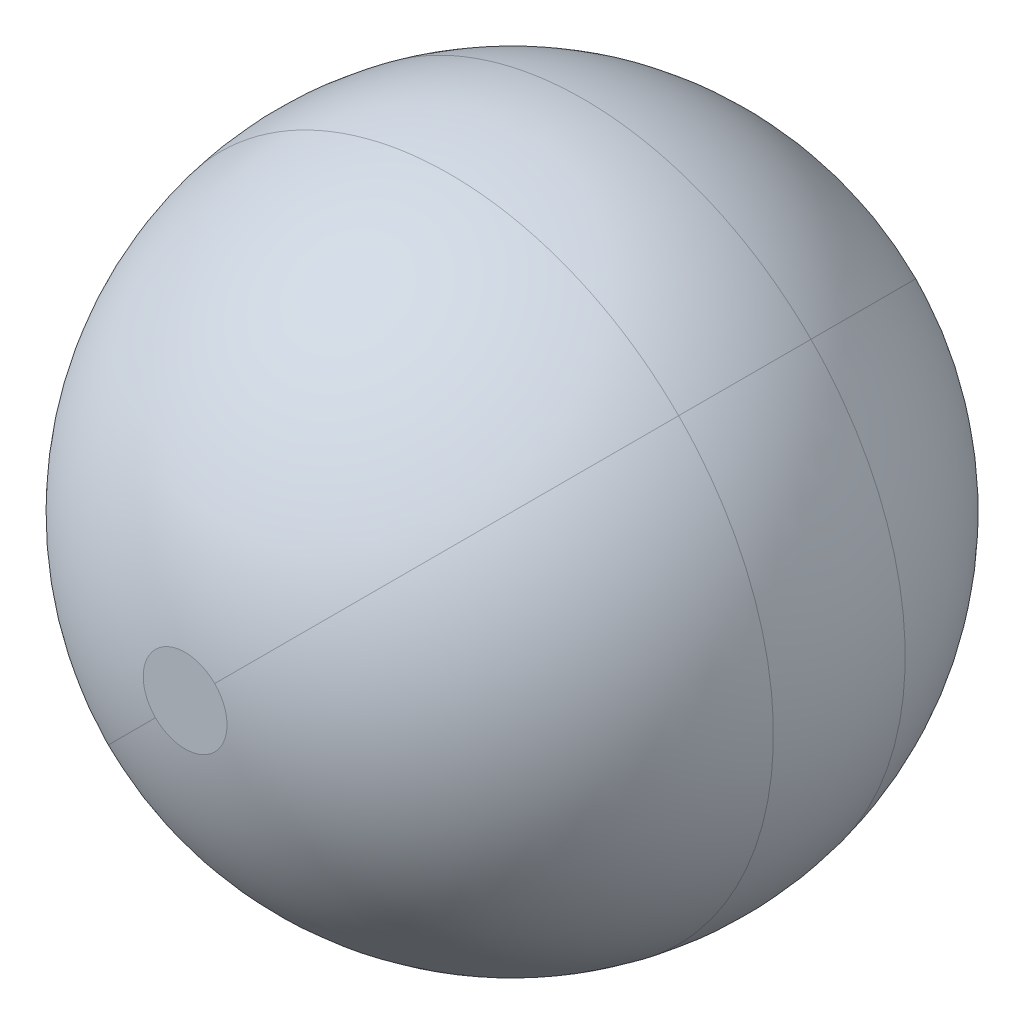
ISO-10303-21;
HEADER;
FILE_DESCRIPTION(('STEP AP214'),'2;1');
FILE_NAME('part.step','',(''),(''),'','','');
FILE_SCHEMA(('AUTOMOTIVE_DESIGN { 1 0 10303 214 1 1 1 1 }'));
ENDSEC;
DATA;
#1=APPLICATION_CONTEXT('core data for automotive mechanical design processes');
#2=APPLICATION_PROTOCOL_DEFINITION('international standard','automotive_design',2000,#1);
#3=PRODUCT_CONTEXT('',#1,'mechanical');
#4=PRODUCT('Part','Part','',(#3));
#5=PRODUCT_RELATED_PRODUCT_CATEGORY('part','',(#4));
#6=PRODUCT_DEFINITION_FORMATION('','',#4);
#7=PRODUCT_DEFINITION_CONTEXT('part definition',#1,'design');
#8=PRODUCT_DEFINITION('design','',#6,#7);
#9=PRODUCT_DEFINITION_SHAPE('','',#8);
#10=(LENGTH_UNIT() NAMED_UNIT(*) SI_UNIT(.MILLI.,.METRE.));
#11=(NAMED_UNIT(*) PLANE_ANGLE_UNIT() SI_UNIT($,.RADIAN.));
#12=(NAMED_UNIT(*) SI_UNIT($,.STERADIAN.) SOLID_ANGLE_UNIT());
#13=UNCERTAINTY_MEASURE_WITH_UNIT(LENGTH_MEASURE(1.E-05),#10,'distance_accuracy_value','');
#14=(GEOMETRIC_REPRESENTATION_CONTEXT(3) GLOBAL_UNCERTAINTY_ASSIGNED_CONTEXT((#13)) GLOBAL_UNIT_ASSIGNED_CONTEXT((#10,
#11,#12)) REPRESENTATION_CONTEXT('',''));
#15=CARTESIAN_POINT('',(0.,0.,0.));
#16=DIRECTION('',(0.,0.,1.));
#17=DIRECTION('',(1.,0.,0.));
#18=AXIS2_PLACEMENT_3D('',#15,#16,#17);
#19=CARTESIAN_POINT('',(0.,0.,0.));
#20=DIRECTION('',(0.,-1.,0.));
#21=DIRECTION('',(-1.,0.,0.));
#22=AXIS2_PLACEMENT_3D('',#19,#20,#21);
#23=SPHERICAL_SURFACE('',#22,2.466);
#24=CARTESIAN_POINT('',(0.,0.,0.));
#25=DIRECTION('',(-0.707106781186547,0.707106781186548,0.));
#26=DIRECTION('',(-0.707106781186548,-0.707106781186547,0.));
#27=AXIS2_PLACEMENT_3D('',#24,#25,#26);
#28=CIRCLE('',#27,2.466);
#29=CARTESIAN_POINT('',(1.70235131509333,1.70235131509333,-0.534));
#30=VERTEX_POINT('',#29);
#31=CARTESIAN_POINT('',(1.71230838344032,1.71230838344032,0.466));
#32=VERTEX_POINT('',#31);
#33=EDGE_CURVE('E99',#30,#32,#28,.F.);
#34=ORIENTED_EDGE('',*,*,#33,.F.);
#35=CARTESIAN_POINT('',(0.,0.,-0.534));
#36=DIRECTION('',(0.,0.,1.));
#37=DIRECTION('',(1.,0.,0.));
#38=AXIS2_PLACEMENT_3D('',#35,#36,#37);
#39=CIRCLE('',#38,2.40748831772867);
#40=CARTESIAN_POINT('',(-1.70235131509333,-1.70235131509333,-0.534));
#41=VERTEX_POINT('',#40);
#42=EDGE_CURVE('E12',#30,#41,#39,.T.);
#43=ORIENTED_EDGE('',*,*,#42,.T.);
#44=CARTESIAN_POINT('',(-1.71230838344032,-1.71230838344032,0.466));
#45=VERTEX_POINT('',#44);
#46=EDGE_CURVE('E96',#45,#41,#28,.F.);
#47=ORIENTED_EDGE('',*,*,#46,.F.);
#48=CARTESIAN_POINT('',(0.,0.,0.466));
#49=DIRECTION('',(0.,0.,1.));
#50=DIRECTION('',(1.,0.,0.));
#51=AXIS2_PLACEMENT_3D('',#48,#49,#50);
#52=CIRCLE('',#51,2.42156973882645);
#53=EDGE_CURVE('E56',#32,#45,#52,.T.);
#54=ORIENTED_EDGE('',*,*,#53,.F.);
#55=EDGE_LOOP('',(#34,#43,#47,#54));
#56=FACE_BOUND('',#55,.T.);
#57=ADVANCED_FACE('F48',(#56),#23,.T.);
#58=CARTESIAN_POINT('',(0.221630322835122,0.221630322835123,2.446));
#59=VERTEX_POINT('',#58);
#60=EDGE_CURVE('E109',#32,#59,#28,.F.);
#61=ORIENTED_EDGE('',*,*,#60,.F.);
#62=ORIENTED_EDGE('',*,*,#53,.T.);
#63=CARTESIAN_POINT('',(-0.221630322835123,-0.221630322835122,2.446));
#64=VERTEX_POINT('',#63);
#65=EDGE_CURVE('E111',#64,#45,#28,.F.);
#66=ORIENTED_EDGE('',*,*,#65,.F.);
#67=CARTESIAN_POINT('',(0.,0.,2.446));
#68=DIRECTION('',(0.,0.,-1.));
#69=DIRECTION('',(-1.,0.,0.));
#70=AXIS2_PLACEMENT_3D('',#67,#68,#69);
#71=CIRCLE('',#70,0.313432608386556);
#72=EDGE_CURVE('E106',#64,#59,#71,.T.);
#73=ORIENTED_EDGE('',*,*,#72,.T.);
#74=EDGE_LOOP('',(#61,#62,#66,#73));
#75=FACE_BOUND('',#74,.T.);
#76=ADVANCED_FACE('F123',(#75),#23,.T.);
#77=ORIENTED_EDGE('',*,*,#46,.T.);
#78=CARTESIAN_POINT('',(0.,0.,-0.534));
#79=DIRECTION('',(0.,0.,1.));
#80=DIRECTION('',(1.,0.,0.));
#81=AXIS2_PLACEMENT_3D('',#78,#79,#80);
#82=CIRCLE('',#81,2.40748831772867);
#83=EDGE_CURVE('E92',#41,#30,#82,.T.);
#84=ORIENTED_EDGE('',*,*,#83,.T.);
#85=ORIENTED_EDGE('',*,*,#33,.T.);
#86=CARTESIAN_POINT('',(0.,0.,0.466));
#87=DIRECTION('',(0.,0.,1.));
#88=DIRECTION('',(1.,0.,0.));
#89=AXIS2_PLACEMENT_3D('',#86,#87,#88);
#90=CIRCLE('',#89,2.42156973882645);
#91=EDGE_CURVE('E103',#45,#32,#90,.T.);
#92=ORIENTED_EDGE('',*,*,#91,.F.);
#93=EDGE_LOOP('',(#77,#84,#85,#92));
#94=FACE_BOUND('',#93,.T.);
#95=ADVANCED_FACE('F126',(#94),#23,.T.);
#96=ORIENTED_EDGE('',*,*,#65,.T.);
#97=ORIENTED_EDGE('',*,*,#91,.T.);
#98=ORIENTED_EDGE('',*,*,#60,.T.);
#99=CARTESIAN_POINT('',(0.,0.,2.446));
#100=DIRECTION('',(0.,0.,-1.));
#101=DIRECTION('',(-1.,0.,0.));
#102=AXIS2_PLACEMENT_3D('',#99,#100,#101);
#103=CIRCLE('',#102,0.313432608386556);
#104=EDGE_CURVE('E104',#59,#64,#103,.T.);
#105=ORIENTED_EDGE('',*,*,#104,.T.);
#106=EDGE_LOOP('',(#96,#97,#98,#105));
#107=FACE_BOUND('',#106,.T.);
#108=ADVANCED_FACE('F129',(#107),#23,.T.);
#109=ORIENTED_EDGE('',*,*,#42,.F.);
#110=CARTESIAN_POINT('',(0.156875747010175,0.156875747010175,-2.456));
#111=VERTEX_POINT('',#110);
#112=EDGE_CURVE('E97',#111,#30,#28,.F.);
#113=ORIENTED_EDGE('',*,*,#112,.F.);
#114=CARTESIAN_POINT('',(0.,0.,-2.456));
#115=DIRECTION('',(0.,0.,-1.));
#116=DIRECTION('',(-1.,0.,0.));
#117=AXIS2_PLACEMENT_3D('',#114,#115,#116);
#118=CIRCLE('',#117,0.221855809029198);
#119=CARTESIAN_POINT('',(-0.156875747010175,-0.156875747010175,-2.456));
#120=VERTEX_POINT('',#119);
#121=EDGE_CURVE('E102',#120,#111,#118,.T.);
#122=ORIENTED_EDGE('',*,*,#121,.F.);
#123=EDGE_CURVE('E87',#41,#120,#28,.F.);
#124=ORIENTED_EDGE('',*,*,#123,.F.);
#125=EDGE_LOOP('',(#109,#113,#122,#124));
#126=FACE_BOUND('',#125,.T.);
#127=ADVANCED_FACE('F50',(#126),#23,.T.);
#128=ORIENTED_EDGE('',*,*,#83,.F.);
#129=ORIENTED_EDGE('',*,*,#123,.T.);
#130=CARTESIAN_POINT('',(0.,0.,-2.456));
#131=DIRECTION('',(0.,0.,-1.));
#132=DIRECTION('',(-1.,0.,0.));
#133=AXIS2_PLACEMENT_3D('',#130,#131,#132);
#134=CIRCLE('',#133,0.221855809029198);
#135=EDGE_CURVE('E91',#111,#120,#134,.T.);
#136=ORIENTED_EDGE('',*,*,#135,.F.);
#137=ORIENTED_EDGE('',*,*,#112,.T.);
#138=EDGE_LOOP('',(#128,#129,#136,#137));
#139=FACE_BOUND('',#138,.T.);
#140=ADVANCED_FACE('F89',(#139),#23,.T.);
#141=CARTESIAN_POINT('',(0.,0.,2.446));
#142=DIRECTION('',(0.,0.,-1.));
#143=DIRECTION('',(1.,0.,0.));
#144=AXIS2_PLACEMENT_3D('',#141,#142,#143);
#145=PLANE('',#144);
#146=ORIENTED_EDGE('',*,*,#104,.F.);
#147=ORIENTED_EDGE('',*,*,#72,.F.);
#148=EDGE_LOOP('',(#146,#147));
#149=FACE_BOUND('',#148,.T.);
#150=ADVANCED_FACE('F132',(#149),#145,.F.);
#151=CARTESIAN_POINT('',(0.,0.,-2.456));
#152=DIRECTION('',(0.,0.,-1.));
#153=DIRECTION('',(1.,0.,0.));
#154=AXIS2_PLACEMENT_3D('',#151,#152,#153);
#155=PLANE('',#154);
#156=ORIENTED_EDGE('',*,*,#121,.T.);
#157=ORIENTED_EDGE('',*,*,#135,.T.);
#158=EDGE_LOOP('',(#156,#157));
#159=FACE_BOUND('',#158,.T.);
#160=ADVANCED_FACE('F101',(#159),#155,.T.);
#161=CLOSED_SHELL('',(#57,#76,#95,#108,#127,#140,#150,#160));
#162=MANIFOLD_SOLID_BREP('B2',#161);
#163=ADVANCED_BREP_SHAPE_REPRESENTATION('',(#18,#162),#14);
#164=SHAPE_DEFINITION_REPRESENTATION(#9,#163);
ENDSEC;
END-ISO-10303-21;
